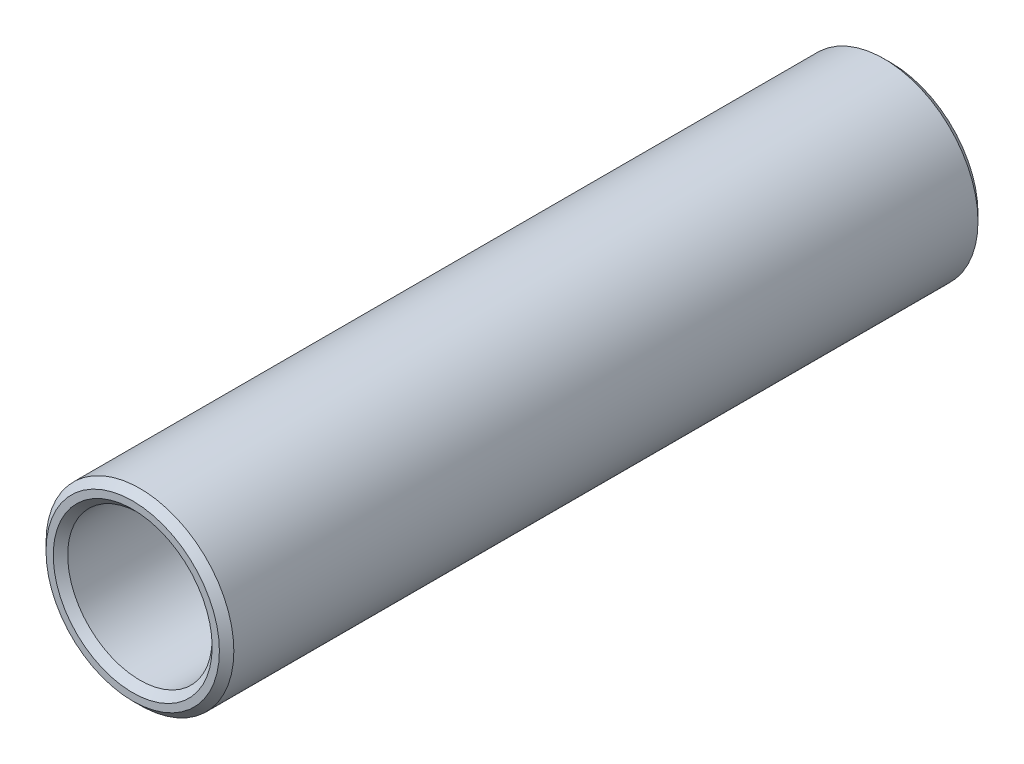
from build123d import *

# Parameters (mm, degrees)
ESQUISSE1_R      = 13
ESQUISSE1_R_2    = 10
EXTRUSION1_DEPTH = 105
CHANFREIN1_SIZE  = 1


with BuildPart() as part:
    # Esquisse1 → Extrusion1 (new body)
    with BuildSketch(Plane.XY):
        Circle(ESQUISSE1_R)
        Circle(ESQUISSE1_R_2, mode=Mode.SUBTRACT)
    extrude(amount=EXTRUSION1_DEPTH)

    # Chanfrein1
    chanfrein1_edges = [part.edges().sort_by_distance(p)[0] for p in [
        (-13, 0, 0),
        (-13, 0, 105),
        (-10, 0, 0),
        (-10, 0, 105),
    ]]
    chamfer(chanfrein1_edges, length=CHANFREIN1_SIZE)


solid = part.part
